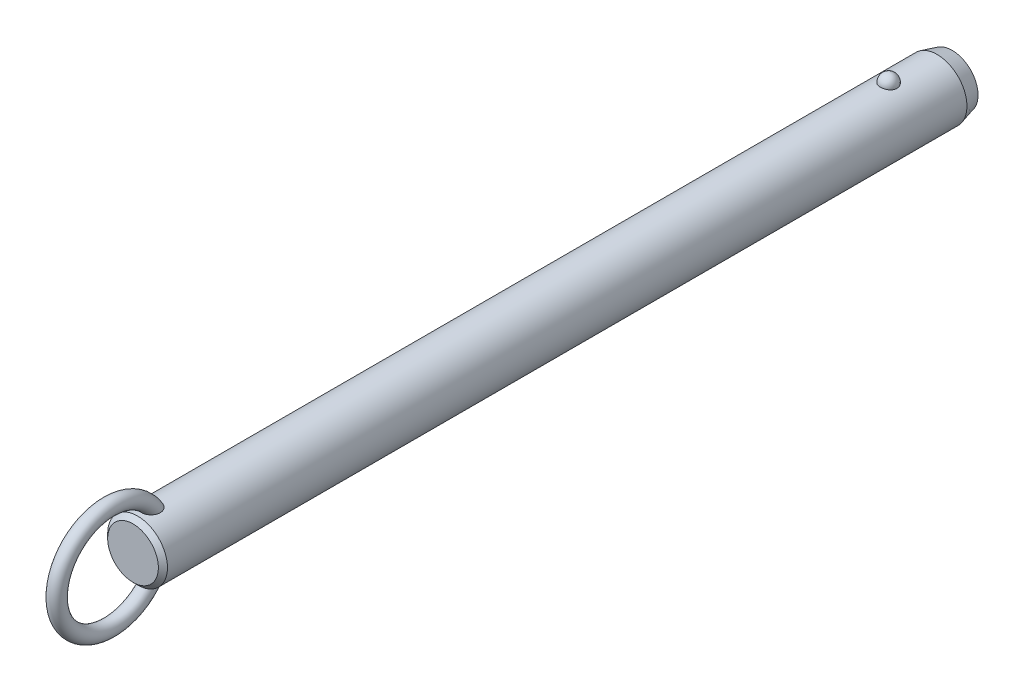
ISO-10303-21;
HEADER;
FILE_DESCRIPTION(('STEP AP214'),'2;1');
FILE_NAME('part.step','',(''),(''),'','','');
FILE_SCHEMA(('AUTOMOTIVE_DESIGN { 1 0 10303 214 1 1 1 1 }'));
ENDSEC;
DATA;
#1=APPLICATION_CONTEXT('core data for automotive mechanical design processes');
#2=APPLICATION_PROTOCOL_DEFINITION('international standard','automotive_design',2000,#1);
#3=PRODUCT_CONTEXT('',#1,'mechanical');
#4=PRODUCT('Part','Part','',(#3));
#5=PRODUCT_RELATED_PRODUCT_CATEGORY('part','',(#4));
#6=PRODUCT_DEFINITION_FORMATION('','',#4);
#7=PRODUCT_DEFINITION_CONTEXT('part definition',#1,'design');
#8=PRODUCT_DEFINITION('design','',#6,#7);
#9=PRODUCT_DEFINITION_SHAPE('','',#8);
#10=(LENGTH_UNIT() NAMED_UNIT(*) SI_UNIT(.MILLI.,.METRE.));
#11=(NAMED_UNIT(*) PLANE_ANGLE_UNIT() SI_UNIT($,.RADIAN.));
#12=(NAMED_UNIT(*) SI_UNIT($,.STERADIAN.) SOLID_ANGLE_UNIT());
#13=UNCERTAINTY_MEASURE_WITH_UNIT(LENGTH_MEASURE(1.E-05),#10,'distance_accuracy_value','');
#14=(GEOMETRIC_REPRESENTATION_CONTEXT(3) GLOBAL_UNCERTAINTY_ASSIGNED_CONTEXT((#13)) GLOBAL_UNIT_ASSIGNED_CONTEXT((#10,
#11,#12)) REPRESENTATION_CONTEXT('',''));
#15=CARTESIAN_POINT('',(0.,0.,0.));
#16=DIRECTION('',(0.,0.,1.));
#17=DIRECTION('',(1.,0.,0.));
#18=AXIS2_PLACEMENT_3D('',#15,#16,#17);
#19=CARTESIAN_POINT('',(0.,0.,188.));
#20=DIRECTION('',(0.,0.,-1.));
#21=DIRECTION('',(-1.,0.,0.));
#22=AXIS2_PLACEMENT_3D('',#19,#20,#21);
#23=CYLINDRICAL_SURFACE('',#22,7.9);
#24=CARTESIAN_POINT('',(2.1785689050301,7.59367088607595,-2.20000000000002));
#25=CARTESIAN_POINT('',(2.17856679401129,7.59367269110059,-2.07701843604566));
#26=CARTESIAN_POINT('',(2.16853481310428,7.59657145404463,-1.95401006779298));
#27=CARTESIAN_POINT('',(2.12864689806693,7.607843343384,-1.71147811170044));
#28=CARTESIAN_POINT('',(2.09878338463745,7.61621856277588,-1.5919558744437));
#29=CARTESIAN_POINT('',(2.0199931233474,7.63749180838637,-1.35985638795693));
#30=CARTESIAN_POINT('',(1.97107475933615,7.6503878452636,-1.24727610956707));
#31=CARTESIAN_POINT('',(1.85539377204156,7.67926115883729,-1.03213234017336));
#32=CARTESIAN_POINT('',(1.78863158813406,7.69523835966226,-0.929568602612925));
#33=CARTESIAN_POINT('',(1.63856494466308,7.7285848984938,-0.73678633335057));
#34=CARTESIAN_POINT('',(1.55518140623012,7.7459606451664,-0.646630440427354));
#35=CARTESIAN_POINT('',(1.37422937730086,7.78009978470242,-0.481747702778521));
#36=CARTESIAN_POINT('',(1.27666086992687,7.79686317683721,-0.407020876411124));
#37=CARTESIAN_POINT('',(1.07024728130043,7.82786153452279,-0.275278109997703));
#38=CARTESIAN_POINT('',(0.961434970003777,7.84210353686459,-0.218212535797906));
#39=CARTESIAN_POINT('',(0.735351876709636,7.86652194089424,-0.123146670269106));
#40=CARTESIAN_POINT('',(0.618082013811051,7.87669878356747,-0.0851443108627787));
#41=CARTESIAN_POINT('',(0.380637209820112,7.89170521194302,-0.0298158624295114));
#42=CARTESIAN_POINT('',(0.260550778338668,7.89662650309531,-0.0121347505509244));
#43=CARTESIAN_POINT('',(0.0190117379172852,7.90090003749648,0.00324379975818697));
#44=CARTESIAN_POINT('',(-0.102440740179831,7.90025280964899,0.000943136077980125));
#45=CARTESIAN_POINT('',(-0.341452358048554,7.89351056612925,-0.0233955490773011));
#46=CARTESIAN_POINT('',(-0.459042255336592,7.88749257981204,-0.0451545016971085));
#47=CARTESIAN_POINT('',(-0.688796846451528,7.87075812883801,-0.107408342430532));
#48=CARTESIAN_POINT('',(-0.800961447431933,7.86004158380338,-0.14790355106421));
#49=CARTESIAN_POINT('',(-1.01743634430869,7.83497131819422,-0.246799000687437));
#50=CARTESIAN_POINT('',(-1.12169791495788,7.82059709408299,-0.305300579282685));
#51=CARTESIAN_POINT('',(-1.31891765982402,7.78976470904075,-0.43854939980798));
#52=CARTESIAN_POINT('',(-1.41187469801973,7.77330633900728,-0.513298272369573));
#53=CARTESIAN_POINT('',(-1.58577142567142,7.73972434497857,-0.678622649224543));
#54=CARTESIAN_POINT('',(-1.66645140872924,7.72259402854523,-0.769470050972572));
#55=CARTESIAN_POINT('',(-1.81161503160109,7.68983776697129,-0.963538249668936));
#56=CARTESIAN_POINT('',(-1.87609753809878,7.6742119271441,-1.0667599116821));
#57=CARTESIAN_POINT('',(-1.98790138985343,7.6460202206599,-1.28401170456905));
#58=CARTESIAN_POINT('',(-2.03501994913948,7.63349104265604,-1.39815107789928));
#59=CARTESIAN_POINT('',(-2.10986724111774,7.6131449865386,-1.6330178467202));
#60=CARTESIAN_POINT('',(-2.1375965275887,7.60532797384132,-1.75374505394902));
#61=CARTESIAN_POINT('',(-2.17289256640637,7.5953195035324,-1.99782562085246));
#62=CARTESIAN_POINT('',(-2.18054294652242,7.59310471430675,-2.12116592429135));
#63=CARTESIAN_POINT('',(-2.17572919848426,7.59448538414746,-2.36741799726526));
#64=CARTESIAN_POINT('',(-2.1632656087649,7.59808068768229,-2.49032977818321));
#65=CARTESIAN_POINT('',(-2.11865035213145,7.61064035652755,-2.73161015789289));
#66=CARTESIAN_POINT('',(-2.08659579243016,7.61957823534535,-2.84999812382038));
#67=CARTESIAN_POINT('',(-2.00367799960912,7.64179982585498,-3.07955956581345));
#68=CARTESIAN_POINT('',(-1.9528140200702,7.65508371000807,-3.19073275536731));
#69=CARTESIAN_POINT('',(-1.83321113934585,7.68460381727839,-3.40337899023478));
#70=CARTESIAN_POINT('',(-1.76437735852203,7.70085556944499,-3.5047965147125));
#71=CARTESIAN_POINT('',(-1.61069526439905,7.73445734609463,-3.69446912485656));
#72=CARTESIAN_POINT('',(-1.52584634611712,7.75180741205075,-3.78272371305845));
#73=CARTESIAN_POINT('',(-1.34198059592,7.78574608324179,-3.94393987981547));
#74=CARTESIAN_POINT('',(-1.24291308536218,7.80233167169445,-4.01684434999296));
#75=CARTESIAN_POINT('',(-1.03352039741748,7.83281625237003,-4.14489386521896));
#76=CARTESIAN_POINT('',(-0.92319600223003,7.84671543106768,-4.20004014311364));
#77=CARTESIAN_POINT('',(-0.695822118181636,7.87011575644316,-4.29042017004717));
#78=CARTESIAN_POINT('',(-0.578872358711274,7.87966903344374,-4.32589112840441));
#79=CARTESIAN_POINT('',(-0.340410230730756,7.8935652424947,-4.37692226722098));
#80=CARTESIAN_POINT('',(-0.218898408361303,7.89790879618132,-4.39248482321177));
#81=CARTESIAN_POINT('',(0.0228107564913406,7.90087453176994,-4.40314405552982));
#82=CARTESIAN_POINT('',(0.142990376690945,7.89960185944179,-4.39861683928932));
#83=CARTESIAN_POINT('',(0.380829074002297,7.89171262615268,-4.37008293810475));
#84=CARTESIAN_POINT('',(0.498488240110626,7.8850962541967,-4.34607694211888));
#85=CARTESIAN_POINT('',(0.727535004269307,7.86726442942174,-4.27939317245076));
#86=CARTESIAN_POINT('',(0.838944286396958,7.85606616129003,-4.23678512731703));
#87=CARTESIAN_POINT('',(1.05295421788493,7.83025654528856,-4.13408348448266));
#88=CARTESIAN_POINT('',(1.15555431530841,7.81564498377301,-4.07398879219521));
#89=CARTESIAN_POINT('',(1.35076763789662,7.7843022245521,-3.93687432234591));
#90=CARTESIAN_POINT('',(1.4432046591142,7.76754209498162,-3.85961036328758));
#91=CARTESIAN_POINT('',(1.6139111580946,7.73387857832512,-3.69076949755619));
#92=CARTESIAN_POINT('',(1.6921781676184,7.71697516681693,-3.59919010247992));
#93=CARTESIAN_POINT('',(1.83380875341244,7.6845643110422,-3.40247278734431));
#94=CARTESIAN_POINT('',(1.89689280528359,7.66908588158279,-3.29712873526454));
#95=CARTESIAN_POINT('',(2.0047823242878,7.64159441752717,-3.07707931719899));
#96=CARTESIAN_POINT('',(2.0495945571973,7.62958010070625,-2.96237743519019));
#97=CARTESIAN_POINT('',(2.11580183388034,7.61146617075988,-2.74040519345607));
#98=CARTESIAN_POINT('',(2.13929812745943,7.60484503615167,-2.63379846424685));
#99=CARTESIAN_POINT('',(2.17068242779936,7.59594664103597,-2.4181348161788));
#100=CARTESIAN_POINT('',(2.17857077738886,7.59366928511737,-2.30907795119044));
#101=CARTESIAN_POINT('',(2.1785689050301,7.59367088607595,-2.20000000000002));
#102=B_SPLINE_CURVE_WITH_KNOTS('',3,(#24,#25,#26,#27,#28,#29,#30,#31,#32,#33,#34,#35,#36,#37,
#38,#39,#40,#41,#42,#43,#44,#45,#46,#47,#48,#49,#50,#51,#52,#53,#54,#55,#56,#57,#58,#59,#60,#61,
#62,#63,#64,#65,#66,#67,#68,#69,#70,#71,#72,#73,#74,#75,#76,#77,#78,#79,#80,#81,#82,#83,#84,#85,
#86,#87,#88,#89,#90,#91,#92,#93,#94,#95,#96,#97,#98,#99,#100,#101),.UNSPECIFIED.,.T.,.F.,(4,2,2,
2,2,2,2,2,2,2,2,2,2,2,2,2,2,2,2,2,2,2,2,2,2,2,2,2,2,2,2,2,2,2,2,2,2,2,4),(0.,0.368552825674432,
0.737246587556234,1.10577831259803,1.4743009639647,1.8446206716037,2.21494081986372,
2.5842105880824,2.95344028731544,3.31611630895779,3.67875788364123,4.03628044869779,
4.39380913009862,4.75338791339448,5.11300280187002,5.47939989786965,5.8458226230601,
6.21639834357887,6.58696347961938,6.95598276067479,7.32499216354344,7.69218715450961,
8.0593967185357,8.42858578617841,8.79778880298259,9.16834203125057,9.5388695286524,
9.90482699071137,10.2707407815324,10.6298333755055,10.9889132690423,11.3466585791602,
11.7044262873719,12.0676511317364,12.4309391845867,12.8004764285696,13.1698767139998,
13.4967701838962,13.8236564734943),.UNSPECIFIED.);
#103=CARTESIAN_POINT('',(2.1785689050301,7.59367088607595,-2.20000000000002));
#104=VERTEX_POINT('',#103);
#105=EDGE_CURVE('E41',#104,#104,#102,.T.);
#106=ORIENTED_EDGE('',*,*,#105,.T.);
#107=EDGE_LOOP('',(#106));
#108=FACE_BOUND('',#107,.T.);
#109=CARTESIAN_POINT('',(0.,0.,196.32));
#110=DIRECTION('',(0.,0.,1.));
#111=DIRECTION('',(1.,0.,0.));
#112=AXIS2_PLACEMENT_3D('',#109,#110,#111);
#113=CIRCLE('',#112,7.9);
#114=CARTESIAN_POINT('',(7.9,0.,196.32));
#115=VERTEX_POINT('',#114);
#116=EDGE_CURVE('E10',#115,#115,#113,.F.);
#117=ORIENTED_EDGE('',*,*,#116,.T.);
#118=EDGE_LOOP('',(#117));
#119=FACE_BOUND('',#118,.T.);
#120=CARTESIAN_POINT('',(-0.630969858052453,-7.87476203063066,190.212432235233));
#121=CARTESIAN_POINT('',(-0.734180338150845,-7.86648998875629,190.247285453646));
#122=CARTESIAN_POINT('',(-0.83447695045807,-7.85639291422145,190.290816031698));
#123=CARTESIAN_POINT('',(-1.0262035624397,-7.83366343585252,190.394094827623));
#124=CARTESIAN_POINT('',(-1.1176141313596,-7.82102565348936,190.453877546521));
#125=CARTESIAN_POINT('',(-1.28877277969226,-7.79464922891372,190.587839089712));
#126=CARTESIAN_POINT('',(-1.36854014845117,-7.78091246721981,190.661993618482));
#127=CARTESIAN_POINT('',(-1.51461521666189,-7.75380398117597,190.822494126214));
#128=CARTESIAN_POINT('',(-1.58092966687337,-7.74043207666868,190.908833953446));
#129=CARTESIAN_POINT('',(-1.70019064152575,-7.7151252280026,191.092978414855));
#130=CARTESIAN_POINT('',(-1.75284037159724,-7.70322473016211,191.190979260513));
#131=CARTESIAN_POINT('',(-1.84263464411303,-7.68224112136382,191.394102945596));
#132=CARTESIAN_POINT('',(-1.87977299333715,-7.6731591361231,191.499228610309));
#133=CARTESIAN_POINT('',(-1.94152728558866,-7.65777930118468,191.723284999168));
#134=CARTESIAN_POINT('',(-1.96475471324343,-7.65179654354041,191.842616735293));
#135=CARTESIAN_POINT('',(-1.99449499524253,-7.64409642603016,192.08342986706));
#136=CARTESIAN_POINT('',(-2.0010005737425,-7.64238092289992,192.204912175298));
#137=CARTESIAN_POINT('',(-1.99856014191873,-7.64302120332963,192.468340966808));
#138=CARTESIAN_POINT('',(-1.98680021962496,-7.64611845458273,192.61025654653));
#139=CARTESIAN_POINT('',(-1.94457772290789,-7.65696186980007,192.891118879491));
#140=CARTESIAN_POINT('',(-1.91409393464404,-7.66471330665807,193.030062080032));
#141=CARTESIAN_POINT('',(-1.82768670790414,-7.68582947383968,193.331939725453));
#142=CARTESIAN_POINT('',(-1.76772963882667,-7.70003779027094,193.493686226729));
#143=CARTESIAN_POINT('',(-1.65998501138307,-7.72371550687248,193.727695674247));
#144=CARTESIAN_POINT('',(-1.621079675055,-7.73200670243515,193.804297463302));
#145=CARTESIAN_POINT('',(-1.53727726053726,-7.74910377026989,193.954079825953));
#146=CARTESIAN_POINT('',(-1.49238215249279,-7.75790947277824,194.027261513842));
#147=CARTESIAN_POINT('',(-1.37397050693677,-7.77993338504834,194.20288382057));
#148=CARTESIAN_POINT('',(-1.29690364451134,-7.79328473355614,194.302955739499));
#149=CARTESIAN_POINT('',(-1.12885487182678,-7.81939266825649,194.490714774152));
#150=CARTESIAN_POINT('',(-1.03789926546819,-7.83215032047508,194.578424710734));
#151=CARTESIAN_POINT('',(-0.869532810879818,-7.85231710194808,194.713414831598));
#152=CARTESIAN_POINT('',(-0.795716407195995,-7.86021093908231,194.765076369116));
#153=CARTESIAN_POINT('',(-0.640813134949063,-7.87434920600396,194.856381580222));
#154=CARTESIAN_POINT('',(-0.559737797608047,-7.88059619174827,194.89604389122));
#155=CARTESIAN_POINT('',(-0.406456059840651,-7.88984116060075,194.954300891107));
#156=CARTESIAN_POINT('',(-0.335227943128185,-7.89321892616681,194.975384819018));
#157=CARTESIAN_POINT('',(-0.190193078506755,-7.89804235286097,195.00541418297));
#158=CARTESIAN_POINT('',(-0.116388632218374,-7.89948969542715,195.014370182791));
#159=CARTESIAN_POINT('',(0.0318414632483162,-7.90028409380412,195.019291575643));
#160=CARTESIAN_POINT('',(0.106268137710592,-7.89962640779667,195.015227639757));
#161=CARTESIAN_POINT('',(0.253290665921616,-7.8962818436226,194.994461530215));
#162=CARTESIAN_POINT('',(0.325885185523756,-7.8935935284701,194.977750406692));
#163=CARTESIAN_POINT('',(0.481441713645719,-7.88577340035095,194.928738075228));
#164=CARTESIAN_POINT('',(0.563611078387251,-7.88026321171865,194.894005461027));
#165=CARTESIAN_POINT('',(0.721129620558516,-7.86741729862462,194.811796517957));
#166=CARTESIAN_POINT('',(0.79646633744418,-7.86007832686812,194.764297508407));
#167=CARTESIAN_POINT('',(0.971456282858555,-7.84073285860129,194.636513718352));
#168=CARTESIAN_POINT('',(1.06719686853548,-7.82809461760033,194.551004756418));
#169=CARTESIAN_POINT('',(1.24418921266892,-7.80192439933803,194.366232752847));
#170=CARTESIAN_POINT('',(1.32540832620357,-7.78839049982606,194.266939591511));
#171=CARTESIAN_POINT('',(1.45199971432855,-7.76559693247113,194.089576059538));
#172=CARTESIAN_POINT('',(1.50085649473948,-7.75626094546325,194.013954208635));
#173=CARTESIAN_POINT('',(1.59197749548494,-7.73807279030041,193.858742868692));
#174=CARTESIAN_POINT('',(1.63423919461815,-7.72922080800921,193.779151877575));
#175=CARTESIAN_POINT('',(1.71222612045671,-7.71231959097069,193.616664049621));
#176=CARTESIAN_POINT('',(1.74794516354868,-7.70427111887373,193.533764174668));
#177=CARTESIAN_POINT('',(1.81270113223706,-7.68929240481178,193.365296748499));
#178=CARTESIAN_POINT('',(1.84173789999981,-7.68236218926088,193.279729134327));
#179=CARTESIAN_POINT('',(1.89322698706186,-7.6698375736,193.10528702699));
#180=CARTESIAN_POINT('',(1.91558744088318,-7.66426199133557,193.016383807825));
#181=CARTESIAN_POINT('',(1.95281367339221,-7.65485915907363,192.836969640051));
#182=CARTESIAN_POINT('',(1.96767946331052,-7.65103190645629,192.746458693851));
#183=CARTESIAN_POINT('',(2.0002145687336,-7.64262981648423,192.473732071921));
#184=CARTESIAN_POINT('',(2.00600691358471,-7.6410871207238,192.289709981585));
#185=CARTESIAN_POINT('',(1.98445334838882,-7.64669564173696,191.976501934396));
#186=CARTESIAN_POINT('',(1.96607186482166,-7.65149688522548,191.846618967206));
#187=CARTESIAN_POINT('',(1.90884967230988,-7.66597624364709,191.591632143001));
#188=CARTESIAN_POINT('',(1.87002101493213,-7.67565148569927,191.466525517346));
#189=CARTESIAN_POINT('',(1.77063986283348,-7.69918471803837,191.22454013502));
#190=CARTESIAN_POINT('',(1.70993724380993,-7.71307150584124,191.107725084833));
#191=CARTESIAN_POINT('',(1.56733070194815,-7.74330306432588,190.888144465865));
#192=CARTESIAN_POINT('',(1.48543692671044,-7.75964665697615,190.785372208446));
#193=CARTESIAN_POINT('',(1.31346177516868,-7.79047523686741,190.609380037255));
#194=CARTESIAN_POINT('',(1.22547278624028,-7.80495298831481,190.534106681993));
#195=CARTESIAN_POINT('',(1.03724352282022,-7.83218597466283,190.400486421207));
#196=CARTESIAN_POINT('',(0.93700840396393,-7.84494192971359,190.342132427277));
#197=CARTESIAN_POINT('',(0.733599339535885,-7.86649045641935,190.247027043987));
#198=CARTESIAN_POINT('',(0.630941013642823,-7.87547134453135,190.209210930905));
#199=CARTESIAN_POINT('',(0.420465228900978,-7.88950708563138,190.151116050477));
#200=CARTESIAN_POINT('',(0.312645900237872,-7.89456050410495,190.13084369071));
#201=CARTESIAN_POINT('',(0.0960869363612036,-7.9001518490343,190.108455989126));
#202=CARTESIAN_POINT('',(-0.0126341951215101,-7.90073226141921,190.106169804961));
#203=CARTESIAN_POINT('',(-0.228766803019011,-7.89742350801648,190.119367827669));
#204=CARTESIAN_POINT('',(-0.336180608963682,-7.89354403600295,190.134813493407));
#205=CARTESIAN_POINT('',(-0.473410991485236,-7.88586871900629,190.166217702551));
#206=CARTESIAN_POINT('',(-0.50525779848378,-7.88388984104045,190.174354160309));
#207=CARTESIAN_POINT('',(-0.56848128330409,-7.87958326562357,190.192208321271));
#208=CARTESIAN_POINT('',(-0.59985795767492,-7.87725556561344,190.201926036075));
#209=CARTESIAN_POINT('',(-0.630969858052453,-7.87476203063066,190.212432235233));
#210=B_SPLINE_CURVE_WITH_KNOTS('',3,(#120,#121,#122,#123,#124,#125,#126,#127,#128,#129,#130,
#131,#132,#133,#134,#135,#136,#137,#138,#139,#140,#141,#142,#143,#144,#145,#146,#147,#148,#149,
#150,#151,#152,#153,#154,#155,#156,#157,#158,#159,#160,#161,#162,#163,#164,#165,#166,#167,#168,
#169,#170,#171,#172,#173,#174,#175,#176,#177,#178,#179,#180,#181,#182,#183,#184,#185,#186,#187,
#188,#189,#190,#191,#192,#193,#194,#195,#196,#197,#198,#199,#200,#201,#202,#203,#204,#205,#206,
#207,#208,#209),.UNSPECIFIED.,.T.,.F.,(4,2,2,2,2,2,2,2,2,2,2,2,2,2,2,2,2,2,2,2,2,2,2,2,2,2,2,2,
2,2,2,2,2,2,2,2,2,2,2,2,2,2,2,2,4),(0.,0.327622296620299,0.655945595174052,0.983718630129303,
1.3113267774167,1.64554655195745,1.97989964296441,2.34365728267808,2.70757317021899,
3.13333684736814,3.5595838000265,4.07655306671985,4.33527897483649,4.59391999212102,
4.97382437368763,5.353017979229,5.62348245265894,5.89352465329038,6.11565959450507,
6.33760092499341,6.56004255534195,6.78264174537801,7.04930844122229,7.31645206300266,
7.70130871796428,8.08701995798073,8.35824509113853,8.6295736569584,8.9011573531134,
9.1727474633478,9.44791855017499,9.72308922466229,10.2715298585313,10.6638393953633,
11.0559179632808,11.4507403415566,11.8453740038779,12.1936425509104,12.5417649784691,
12.8695063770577,13.1973674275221,13.5221104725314,13.8461490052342,13.9449071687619,
14.0436660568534),.UNSPECIFIED.);
#211=CARTESIAN_POINT('',(-0.630969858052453,-7.87476203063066,190.212432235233));
#212=VERTEX_POINT('',#211);
#213=EDGE_CURVE('E59',#212,#212,#210,.T.);
#214=ORIENTED_EDGE('',*,*,#213,.T.);
#215=EDGE_LOOP('',(#214));
#216=FACE_BOUND('',#215,.T.);
#217=CARTESIAN_POINT('',(-0.630969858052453,7.87476203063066,190.212432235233));
#218=CARTESIAN_POINT('',(-0.528918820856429,7.88293636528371,190.177979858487));
#219=CARTESIAN_POINT('',(-0.423745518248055,7.88934810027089,190.151915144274));
#220=CARTESIAN_POINT('',(-0.210236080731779,7.8979273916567,190.117282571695));
#221=CARTESIAN_POINT('',(-0.10189380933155,7.90008607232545,190.108751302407));
#222=CARTESIAN_POINT('',(0.114660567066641,7.89990877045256,190.109457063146));
#223=CARTESIAN_POINT('',(0.222872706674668,7.89757640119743,190.11867980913));
#224=CARTESIAN_POINT('',(0.436107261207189,7.88867538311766,190.154652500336));
#225=CARTESIAN_POINT('',(0.541131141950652,7.8821087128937,190.18139425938));
#226=CARTESIAN_POINT('',(0.745085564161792,7.86545130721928,190.251756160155));
#227=CARTESIAN_POINT('',(0.844015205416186,7.85536005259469,190.295378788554));
#228=CARTESIAN_POINT('',(1.03299167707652,7.83275153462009,190.398379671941));
#229=CARTESIAN_POINT('',(1.12303841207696,7.8202342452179,190.457758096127));
#230=CARTESIAN_POINT('',(1.29214734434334,7.79408219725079,190.590864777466));
#231=CARTESIAN_POINT('',(1.37116907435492,7.78044359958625,190.664643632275));
#232=CARTESIAN_POINT('',(1.51597677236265,7.75353170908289,190.824235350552));
#233=CARTESIAN_POINT('',(1.58176261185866,7.74025841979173,190.910048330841));
#234=CARTESIAN_POINT('',(1.70057386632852,7.71504069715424,191.093644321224));
#235=CARTESIAN_POINT('',(1.75320073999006,7.7031425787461,191.191690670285));
#236=CARTESIAN_POINT('',(1.8429376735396,7.68216822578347,191.394893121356));
#237=CARTESIAN_POINT('',(1.88004278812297,7.67309289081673,191.500051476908));
#238=CARTESIAN_POINT('',(1.9417232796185,7.6577294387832,191.724167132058));
#239=CARTESIAN_POINT('',(1.96491037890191,7.65175648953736,191.843524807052));
#240=CARTESIAN_POINT('',(1.9945689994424,7.64407702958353,192.084384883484));
#241=CARTESIAN_POINT('',(2.00103304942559,7.64237242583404,192.20588821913));
#242=CARTESIAN_POINT('',(1.99850166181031,7.64303650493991,192.469368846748));
#243=CARTESIAN_POINT('',(1.98669038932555,7.64614714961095,192.611314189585));
#244=CARTESIAN_POINT('',(1.94436120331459,7.65701701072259,192.892228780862));
#245=CARTESIAN_POINT('',(1.91382203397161,7.66478150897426,193.031194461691));
#246=CARTESIAN_POINT('',(1.82728754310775,7.68592483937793,193.333111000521));
#247=CARTESIAN_POINT('',(1.76725778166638,7.70014685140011,193.494872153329));
#248=CARTESIAN_POINT('',(1.65939700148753,7.72384204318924,193.728891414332));
#249=CARTESIAN_POINT('',(1.62045187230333,7.73213852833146,193.805494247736));
#250=CARTESIAN_POINT('',(1.5365668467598,7.74924489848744,193.955273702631));
#251=CARTESIAN_POINT('',(1.49162892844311,7.75805461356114,194.028451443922));
#252=CARTESIAN_POINT('',(1.37317698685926,7.78007342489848,194.203952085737));
#253=CARTESIAN_POINT('',(1.29612360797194,7.79341423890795,194.303911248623));
#254=CARTESIAN_POINT('',(1.12812043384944,7.81949839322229,194.49145083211));
#255=CARTESIAN_POINT('',(1.03719688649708,7.83224280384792,194.579054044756));
#256=CARTESIAN_POINT('',(0.868871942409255,7.85239026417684,194.71389715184));
#257=CARTESIAN_POINT('',(0.795056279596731,7.86027769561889,194.765511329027));
#258=CARTESIAN_POINT('',(0.640160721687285,7.87440222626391,194.856720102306));
#259=CARTESIAN_POINT('',(0.559092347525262,7.88064188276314,194.896333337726));
#260=CARTESIAN_POINT('',(0.405820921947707,7.8898738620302,194.954505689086));
#261=CARTESIAN_POINT('',(0.334594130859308,7.89324577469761,194.975552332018));
#262=CARTESIAN_POINT('',(0.189568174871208,7.89805733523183,195.005507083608));
#263=CARTESIAN_POINT('',(0.115771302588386,7.89949866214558,195.014425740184));
#264=CARTESIAN_POINT('',(-0.0324359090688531,7.90028156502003,195.01927589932));
#265=CARTESIAN_POINT('',(-0.106847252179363,7.89961843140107,195.015178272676));
#266=CARTESIAN_POINT('',(-0.253834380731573,7.8962642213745,194.994351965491));
#267=CARTESIAN_POINT('',(-0.326408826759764,7.89357170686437,194.977614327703));
#268=CARTESIAN_POINT('',(-0.481962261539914,7.88574179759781,194.928539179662));
#269=CARTESIAN_POINT('',(-0.564145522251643,7.88022507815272,194.893763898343));
#270=CARTESIAN_POINT('',(-0.721685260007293,7.86736646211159,194.811468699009));
#271=CARTESIAN_POINT('',(-0.797029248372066,7.8600213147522,194.763926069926));
#272=CARTESIAN_POINT('',(-0.9720442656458,7.84066026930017,194.636026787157));
#273=CARTESIAN_POINT('',(-1.06779803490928,7.82801274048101,194.550443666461));
#274=CARTESIAN_POINT('',(-1.2448053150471,7.80182621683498,194.365522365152));
#275=CARTESIAN_POINT('',(-1.32602618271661,7.78828530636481,194.266154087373));
#276=CARTESIAN_POINT('',(-1.45259834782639,7.76548487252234,194.088680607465));
#277=CARTESIAN_POINT('',(-1.50143856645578,7.75614818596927,194.013025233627));
#278=CARTESIAN_POINT('',(-1.59252410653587,7.73796020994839,193.857748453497));
#279=CARTESIAN_POINT('',(-1.63476690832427,7.72910910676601,193.778125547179));
#280=CARTESIAN_POINT('',(-1.71271318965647,7.71221133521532,193.615575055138));
#281=CARTESIAN_POINT('',(-1.74841047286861,7.70416543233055,193.532644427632));
#282=CARTESIAN_POINT('',(-1.81311929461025,7.6891937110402,193.364116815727));
#283=CARTESIAN_POINT('',(-1.84213067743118,7.68226791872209,193.278519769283));
#284=CARTESIAN_POINT('',(-1.89356259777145,7.66975461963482,193.104025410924));
#285=CARTESIAN_POINT('',(-1.91589165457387,7.66418586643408,193.015099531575));
#286=CARTESIAN_POINT('',(-1.9530507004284,7.65479859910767,192.835642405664));
#287=CARTESIAN_POINT('',(-1.96788069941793,7.65098008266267,192.745111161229));
#288=CARTESIAN_POINT('',(-2.00030078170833,7.64260704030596,192.472327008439));
#289=CARTESIAN_POINT('',(-2.00600576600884,7.64108760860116,192.288271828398));
#290=CARTESIAN_POINT('',(-1.9842848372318,7.64673945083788,191.975080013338));
#291=CARTESIAN_POINT('',(-1.96583698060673,7.65155751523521,191.845240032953));
#292=CARTESIAN_POINT('',(-1.90848948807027,7.66606613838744,191.590361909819));
#293=CARTESIAN_POINT('',(-1.86960376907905,7.67575338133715,191.465320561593));
#294=CARTESIAN_POINT('',(-1.77013421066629,7.6993013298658,191.223500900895));
#295=CARTESIAN_POINT('',(-1.70940488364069,7.71318991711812,191.106784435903));
#296=CARTESIAN_POINT('',(-1.56672953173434,7.74342495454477,190.887340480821));
#297=CARTESIAN_POINT('',(-1.48478316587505,7.75977144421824,190.78461321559));
#298=CARTESIAN_POINT('',(-1.31266325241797,7.79061163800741,190.608643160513));
#299=CARTESIAN_POINT('',(-1.22456383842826,7.80509908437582,190.533358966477));
#300=CARTESIAN_POINT('',(-1.03622400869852,7.83231881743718,190.399865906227));
#301=CARTESIAN_POINT('',(-0.936015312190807,7.84505551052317,190.341613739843));
#302=CARTESIAN_POINT('',(-0.798824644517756,7.85957802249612,190.277540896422));
#303=CARTESIAN_POINT('',(-0.765787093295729,7.86286821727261,190.263224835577));
#304=CARTESIAN_POINT('',(-0.698939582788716,7.86909211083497,190.236436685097));
#305=CARTESIAN_POINT('',(-0.66512963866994,7.8720258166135,190.223964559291));
#306=CARTESIAN_POINT('',(-0.630969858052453,7.87476203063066,190.212432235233));
#307=B_SPLINE_CURVE_WITH_KNOTS('',3,(#217,#218,#219,#220,#221,#222,#223,#224,#225,#226,#227,
#228,#229,#230,#231,#232,#233,#234,#235,#236,#237,#238,#239,#240,#241,#242,#243,#244,#245,#246,
#247,#248,#249,#250,#251,#252,#253,#254,#255,#256,#257,#258,#259,#260,#261,#262,#263,#264,#265,
#266,#267,#268,#269,#270,#271,#272,#273,#274,#275,#276,#277,#278,#279,#280,#281,#282,#283,#284,
#285,#286,#287,#288,#289,#290,#291,#292,#293,#294,#295,#296,#297,#298,#299,#300,#301,#302,#303,
#304,#305,#306),.UNSPECIFIED.,.T.,.F.,(4,2,2,2,2,2,2,2,2,2,2,2,2,2,2,2,2,2,2,2,2,2,2,2,2,2,2,2,
2,2,2,2,2,2,2,2,2,2,2,2,2,2,2,2,4),(0.,0.323920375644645,0.648516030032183,0.972850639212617,
1.29703380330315,1.62126473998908,1.94549915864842,2.27089401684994,2.5962920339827,
2.93059633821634,3.26500707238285,3.6288164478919,3.99278833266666,4.41865421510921,
4.84500434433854,5.36209210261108,5.62087589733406,5.87957448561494,6.25918598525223,
6.63808782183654,6.90846748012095,7.17842501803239,7.40052350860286,7.6224287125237,
7.84483086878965,8.06739077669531,8.33414615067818,8.6013792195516,8.98641454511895,
9.37230415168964,9.64358673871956,9.91497268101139,10.1866142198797,10.4582620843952,
10.7334745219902,11.008686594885,11.5572126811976,11.9494246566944,12.3413699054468,
12.7359755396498,13.1305875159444,13.4791770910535,13.82687259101,13.9353013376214,
14.0437279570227),.UNSPECIFIED.);
#308=CARTESIAN_POINT('',(-0.630969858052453,7.87476203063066,190.212432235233));
#309=VERTEX_POINT('',#308);
#310=EDGE_CURVE('E67',#309,#309,#307,.T.);
#311=ORIENTED_EDGE('',*,*,#310,.T.);
#312=EDGE_LOOP('',(#311));
#313=FACE_BOUND('',#312,.T.);
#314=CARTESIAN_POINT('',(0.,0.,-15.));
#315=DIRECTION('',(0.,0.,-1.));
#316=DIRECTION('',(-1.,0.,0.));
#317=AXIS2_PLACEMENT_3D('',#314,#315,#316);
#318=CIRCLE('',#317,7.9);
#319=CARTESIAN_POINT('',(-7.9,0.,-15.));
#320=VERTEX_POINT('',#319);
#321=EDGE_CURVE('E56',#320,#320,#318,.F.);
#322=ORIENTED_EDGE('',*,*,#321,.T.);
#323=EDGE_LOOP('',(#322));
#324=FACE_BOUND('',#323,.T.);
#325=ADVANCED_FACE('F37',(#108,#119,#216,#313,#324),#23,.T.);
#326=CARTESIAN_POINT('',(0.,0.,-19.));
#327=DIRECTION('',(0.,0.,-1.));
#328=DIRECTION('',(-1.,0.,0.));
#329=AXIS2_PLACEMENT_3D('',#326,#327,#328);
#330=PLANE('',#329);
#331=CARTESIAN_POINT('',(0.,0.,-19.));
#332=DIRECTION('',(0.,0.,-1.));
#333=DIRECTION('',(-1.,0.,0.));
#334=AXIS2_PLACEMENT_3D('',#331,#332,#333);
#335=CIRCLE('',#334,6.82820323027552);
#336=CARTESIAN_POINT('',(-6.82820323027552,0.,-19.));
#337=VERTEX_POINT('',#336);
#338=EDGE_CURVE('E66',#337,#337,#335,.T.);
#339=ORIENTED_EDGE('',*,*,#338,.T.);
#340=EDGE_LOOP('',(#339));
#341=FACE_BOUND('',#340,.T.);
#342=ADVANCED_FACE('F85',(#341),#330,.T.);
#343=CARTESIAN_POINT('',(0.,0.,-19.));
#344=DIRECTION('',(0.,0.,1.));
#345=DIRECTION('',(1.,0.,0.));
#346=AXIS2_PLACEMENT_3D('',#343,#344,#345);
#347=CONICAL_SURFACE('',#346,6.82820323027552,0.261799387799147);
#348=ORIENTED_EDGE('',*,*,#321,.F.);
#349=EDGE_LOOP('',(#348));
#350=FACE_BOUND('',#349,.T.);
#351=ORIENTED_EDGE('',*,*,#338,.F.);
#352=EDGE_LOOP('',(#351));
#353=FACE_BOUND('',#352,.T.);
#354=ADVANCED_FACE('F83',(#350,#353),#347,.T.);
#355=CARTESIAN_POINT('',(0.,0.,197.52));
#356=DIRECTION('',(0.,0.,1.));
#357=DIRECTION('',(1.,0.,0.));
#358=AXIS2_PLACEMENT_3D('',#355,#356,#357);
#359=PLANE('',#358);
#360=CARTESIAN_POINT('',(0.,0.,197.52));
#361=DIRECTION('',(0.,0.,1.));
#362=DIRECTION('',(1.,0.,0.));
#363=AXIS2_PLACEMENT_3D('',#360,#361,#362);
#364=CIRCLE('',#363,6.70000000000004);
#365=CARTESIAN_POINT('',(6.70000000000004,0.,197.52));
#366=VERTEX_POINT('',#365);
#367=EDGE_CURVE('E50',#366,#366,#364,.T.);
#368=ORIENTED_EDGE('',*,*,#367,.T.);
#369=EDGE_LOOP('',(#368));
#370=FACE_BOUND('',#369,.T.);
#371=ADVANCED_FACE('F77',(#370),#359,.T.);
#372=CARTESIAN_POINT('',(0.,0.,203.85));
#373=DIRECTION('',(1.,0.,0.));
#374=DIRECTION('',(0.,0.,-1.));
#375=AXIS2_PLACEMENT_3D('',#372,#373,#374);
#376=TOROIDAL_SURFACE('',#375,13.85,2.);
#377=ORIENTED_EDGE('',*,*,#310,.F.);
#378=EDGE_LOOP('',(#377));
#379=FACE_BOUND('',#378,.T.);
#380=ORIENTED_EDGE('',*,*,#213,.F.);
#381=EDGE_LOOP('',(#380));
#382=FACE_BOUND('',#381,.T.);
#383=ADVANCED_FACE('F73',(#379,#382),#376,.T.);
#384=CARTESIAN_POINT('',(0.,0.,197.52));
#385=DIRECTION('',(0.,0.,-1.));
#386=DIRECTION('',(-1.,0.,0.));
#387=AXIS2_PLACEMENT_3D('',#384,#385,#386);
#388=CONICAL_SURFACE('',#387,6.70000000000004,0.785398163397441);
#389=ORIENTED_EDGE('',*,*,#116,.F.);
#390=EDGE_LOOP('',(#389));
#391=FACE_BOUND('',#390,.T.);
#392=ORIENTED_EDGE('',*,*,#367,.F.);
#393=EDGE_LOOP('',(#392));
#394=FACE_BOUND('',#393,.T.);
#395=ADVANCED_FACE('F39',(#391,#394),#388,.T.);
#396=CARTESIAN_POINT('',(0.,7.9,-2.20000000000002));
#397=DIRECTION('',(0.,1.,0.));
#398=DIRECTION('',(0.,0.,-1.));
#399=AXIS2_PLACEMENT_3D('',#396,#397,#398);
#400=SPHERICAL_SURFACE('',#399,2.2);
#401=ORIENTED_EDGE('',*,*,#105,.F.);
#402=EDGE_LOOP('',(#401));
#403=FACE_BOUND('',#402,.T.);
#404=ADVANCED_FACE('F79',(#403),#400,.T.);
#405=CLOSED_SHELL('',(#325,#342,#354,#371,#383,#395,#404));
#406=MANIFOLD_SOLID_BREP('B2',#405);
#407=ADVANCED_BREP_SHAPE_REPRESENTATION('',(#18,#406),#14);
#408=SHAPE_DEFINITION_REPRESENTATION(#9,#407);
ENDSEC;
END-ISO-10303-21;
